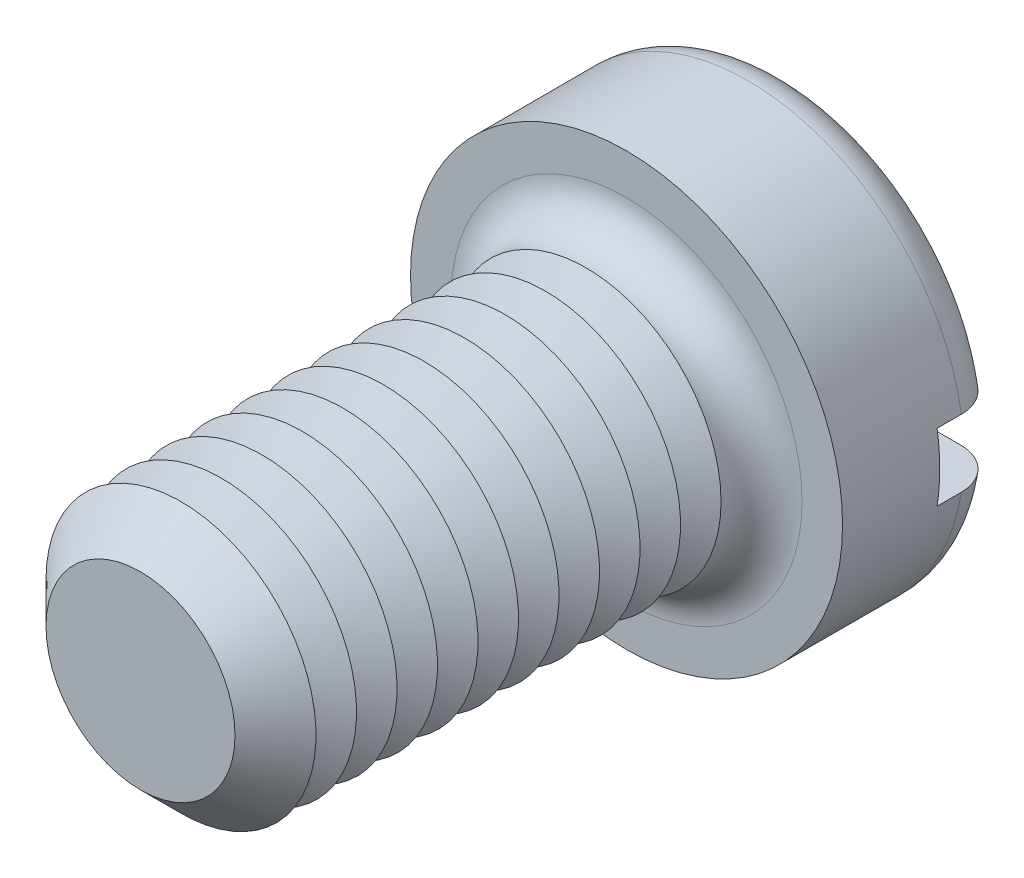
from build123d import *

# Parameters (mm, degrees)
SKETCH3_R           = 8
BOSS_EXTRUDE2_DEPTH = 6
SKETCH4_R           = 5
BOSS_EXTRUDE3_DEPTH = 18
FILLET1_R           = 1.5
CHAMFER1_SIZE       = 1.5
LPATTERN1_COUNT     = 10
LPATTERN1_PITCH     = 1.5
SKETCH8_W           = 16
SKETCH8_H           = 2.5
CUT_EXTRUDE1_DEPTH  = 2.4


with BuildPart() as part:
    # Sketch3 → Boss-Extrude2 (new body)
    with BuildSketch(Plane.XY):
        Circle(SKETCH3_R)
    extrude(amount=-BOSS_EXTRUDE2_DEPTH)

    # Sketch4 → Boss-Extrude3 (add)
    with BuildSketch(Plane.XY):
        Circle(SKETCH4_R)
    extrude(amount=BOSS_EXTRUDE3_DEPTH)

    # Fillet1
    fillet1_edges = [part.edges().sort_by_distance(p)[0] for p in [
        (-8, 0, -6),
        (-5, 0, 0),
    ]]
    fillet(fillet1_edges, radius=FILLET1_R)

    # Chamfer1
    chamfer1_edges = [part.edges().sort_by_distance(p)[0] for p in [
        (-5, 0, 18),
    ]]
    chamfer(chamfer1_edges, length=CHAMFER1_SIZE)

    # Sketch6 → Cut-Revolve1 (revolve, cut)
    with BuildSketch(Plane(origin=(0, 0, 0), x_dir=(0, 0, -1), z_dir=(1, 0, 0)), mode=Mode.PRIVATE) as cut_revolve1_sk:
        Polygon((-1.5, 5), (-2.25, 3.700961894), (-3, 5), align=None)
    cut_revolve1 = revolve(cut_revolve1_sk.sketch.rotate(Axis((0, 0, -1.694361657), (0, 0, 1)), 90), axis=Axis((0, 0, -1.694361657), (0, 0, 1)), mode=Mode.SUBTRACT)

    # LPattern1: Cut-Revolve1 ×10
    with Locations(*[(0, 0, i * LPATTERN1_PITCH) for i in range(1, LPATTERN1_COUNT)]):
        add(cut_revolve1, mode=Mode.SUBTRACT)

    # Sketch8 → Cut-Extrude1 (cut)
    with BuildSketch(Plane(origin=(0, 0, -6), x_dir=(-1, 0, 0), z_dir=(0, 0, -1))):
        Rectangle(SKETCH8_W, SKETCH8_H)
    extrude(amount=-CUT_EXTRUDE1_DEPTH, mode=Mode.SUBTRACT)


solid = part.part
